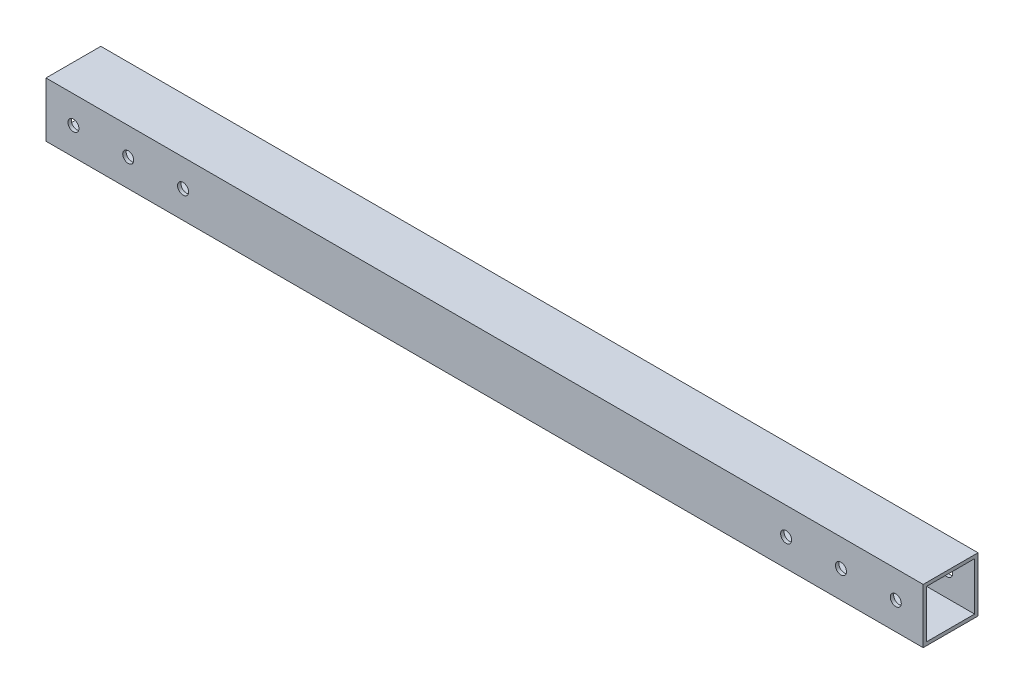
from build123d import *

# Parameters (mm, degrees)
BOSS_EXTRUDE1_DEPTH        = 203.2
BOSS_EXTRUDE1_DEPTH_BACK   = 203.2
SKETCH1_W                  = 25.4
SKETCH1_H                  = 25.4
SKETCH1_W_2                = 22.225
SKETCH1_H_2                = 22.225
F_7_0_201_DIAMETER_HOLE2_D = 5.1054


with BuildPart() as part:
    # Sketch1 → Boss-Extrude1 (new, two sides: drawn at the far end of the back side and taken through both)
    with BuildSketch(Plane(origin=(0, 0, 0), x_dir=(0, 0, -1), z_dir=(1, 0, 0)).offset(-BOSS_EXTRUDE1_DEPTH_BACK)):
        Rectangle(SKETCH1_W, SKETCH1_H)
        Rectangle(SKETCH1_W_2, SKETCH1_H_2, mode=Mode.SUBTRACT)
    extrude(amount=BOSS_EXTRUDE1_DEPTH + BOSS_EXTRUDE1_DEPTH_BACK)

    # 7 _0.201_ Diameter Hole2 (through all)
    with Locations(Plane.XY.offset(12.7)):
        with Locations((190.5, 0), (165.1, 0), (139.7, 0), (-139.7, 0), (-165.1, 0), (-190.5, 0)):
            Hole(F_7_0_201_DIAMETER_HOLE2_D / 2)


solid = part.part
